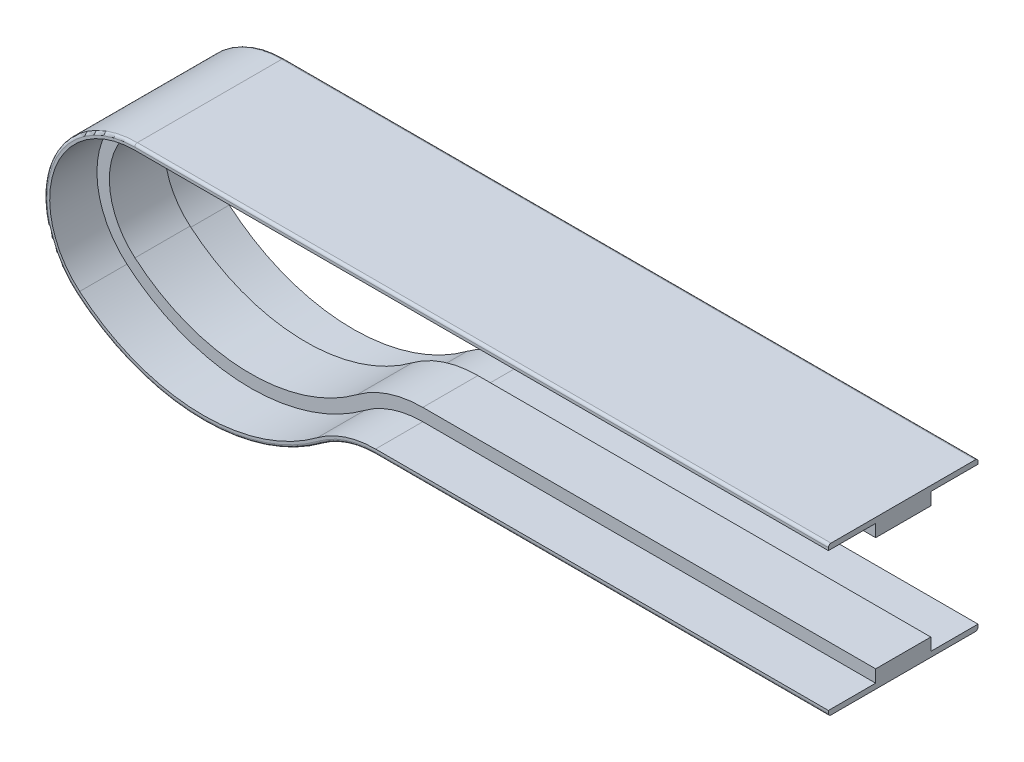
ISO-10303-21;
HEADER;
FILE_DESCRIPTION(('STEP AP214'),'2;1');
FILE_NAME('part.step','',(''),(''),'','','');
FILE_SCHEMA(('AUTOMOTIVE_DESIGN { 1 0 10303 214 1 1 1 1 }'));
ENDSEC;
DATA;
#1=APPLICATION_CONTEXT('core data for automotive mechanical design processes');
#2=APPLICATION_PROTOCOL_DEFINITION('international standard','automotive_design',2000,#1);
#3=PRODUCT_CONTEXT('',#1,'mechanical');
#4=PRODUCT('Part','Part','',(#3));
#5=PRODUCT_RELATED_PRODUCT_CATEGORY('part','',(#4));
#6=PRODUCT_DEFINITION_FORMATION('','',#4);
#7=PRODUCT_DEFINITION_CONTEXT('part definition',#1,'design');
#8=PRODUCT_DEFINITION('design','',#6,#7);
#9=PRODUCT_DEFINITION_SHAPE('','',#8);
#10=(LENGTH_UNIT() NAMED_UNIT(*) SI_UNIT(.MILLI.,.METRE.));
#11=(NAMED_UNIT(*) PLANE_ANGLE_UNIT() SI_UNIT($,.RADIAN.));
#12=(NAMED_UNIT(*) SI_UNIT($,.STERADIAN.) SOLID_ANGLE_UNIT());
#13=UNCERTAINTY_MEASURE_WITH_UNIT(LENGTH_MEASURE(1.E-05),#10,'distance_accuracy_value','');
#14=(GEOMETRIC_REPRESENTATION_CONTEXT(3) GLOBAL_UNCERTAINTY_ASSIGNED_CONTEXT((#13)) GLOBAL_UNIT_ASSIGNED_CONTEXT((#10,
#11,#12)) REPRESENTATION_CONTEXT('',''));
#15=CARTESIAN_POINT('',(0.,0.,0.));
#16=DIRECTION('',(0.,0.,1.));
#17=DIRECTION('',(1.,0.,0.));
#18=AXIS2_PLACEMENT_3D('',#15,#16,#17);
#19=CARTESIAN_POINT('',(-346.,-100.25,21.05));
#20=DIRECTION('',(0.,-1.,0.));
#21=DIRECTION('',(1.,0.,0.));
#22=AXIS2_PLACEMENT_3D('',#19,#20,#21);
#23=PLANE('',#22);
#24=DIRECTION('',(0.,0.,-1.));
#25=VECTOR('',#24,1.);
#26=CARTESIAN_POINT('',(-346.,-100.25,21.05));
#27=LINE('',#26,#25);
#28=CARTESIAN_POINT('',(-346.,-100.25,21.05));
#29=VERTEX_POINT('',#28);
#30=CARTESIAN_POINT('',(-346.,-100.25,-21.0500000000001));
#31=VERTEX_POINT('',#30);
#32=EDGE_CURVE('E418',#29,#31,#27,.T.);
#33=ORIENTED_EDGE('',*,*,#32,.F.);
#34=DIRECTION('',(1.,0.,0.));
#35=VECTOR('',#34,1.);
#36=CARTESIAN_POINT('',(-346.,-100.25,21.05));
#37=LINE('',#36,#35);
#38=CARTESIAN_POINT('',(1.11022302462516E-13,-100.25,21.05));
#39=VERTEX_POINT('',#38);
#40=EDGE_CURVE('E46',#29,#39,#37,.T.);
#41=ORIENTED_EDGE('',*,*,#40,.T.);
#42=DIRECTION('',(0.,0.,-1.));
#43=VECTOR('',#42,1.);
#44=CARTESIAN_POINT('',(1.11022302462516E-13,-100.25,21.05));
#45=LINE('',#44,#43);
#46=CARTESIAN_POINT('',(1.11022302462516E-13,-100.25,-21.05));
#47=VERTEX_POINT('',#46);
#48=EDGE_CURVE('E53',#39,#47,#45,.T.);
#49=ORIENTED_EDGE('',*,*,#48,.T.);
#50=DIRECTION('',(1.,0.,0.));
#51=VECTOR('',#50,1.);
#52=CARTESIAN_POINT('',(-346.,-100.25,-21.0500000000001));
#53=LINE('',#52,#51);
#54=EDGE_CURVE('E11',#31,#47,#53,.T.);
#55=ORIENTED_EDGE('',*,*,#54,.F.);
#56=EDGE_LOOP('',(#33,#41,#49,#55));
#57=FACE_BOUND('',#56,.T.);
#58=ADVANCED_FACE('F38',(#57),#23,.F.);
#59=CARTESIAN_POINT('',(-346.,-109.75,57.15));
#60=DIRECTION('',(0.,-1.,0.));
#61=DIRECTION('',(1.,0.,0.));
#62=AXIS2_PLACEMENT_3D('',#59,#60,#61);
#63=PLANE('',#62);
#64=DIRECTION('',(0.,0.,-1.));
#65=VECTOR('',#64,1.);
#66=CARTESIAN_POINT('',(-346.,-109.75,57.15));
#67=LINE('',#66,#65);
#68=CARTESIAN_POINT('',(-346.,-109.75,57.15));
#69=VERTEX_POINT('',#68);
#70=CARTESIAN_POINT('',(-346.,-109.75,21.05));
#71=VERTEX_POINT('',#70);
#72=EDGE_CURVE('E414',#69,#71,#67,.T.);
#73=ORIENTED_EDGE('',*,*,#72,.F.);
#74=DIRECTION('',(1.,0.,0.));
#75=VECTOR('',#74,1.);
#76=CARTESIAN_POINT('',(-346.,-109.75,57.15));
#77=LINE('',#76,#75);
#78=CARTESIAN_POINT('',(0.,-109.75,57.1500000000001));
#79=VERTEX_POINT('',#78);
#80=EDGE_CURVE('E514',#69,#79,#77,.T.);
#81=ORIENTED_EDGE('',*,*,#80,.T.);
#82=DIRECTION('',(0.,0.,-1.));
#83=VECTOR('',#82,1.);
#84=CARTESIAN_POINT('',(0.,-109.75,57.1500000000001));
#85=LINE('',#84,#83);
#86=CARTESIAN_POINT('',(0.,-109.75,21.05));
#87=VERTEX_POINT('',#86);
#88=EDGE_CURVE('E483',#79,#87,#85,.T.);
#89=ORIENTED_EDGE('',*,*,#88,.T.);
#90=DIRECTION('',(1.,0.,0.));
#91=VECTOR('',#90,1.);
#92=CARTESIAN_POINT('',(-346.,-109.75,21.05));
#93=LINE('',#92,#91);
#94=EDGE_CURVE('E518',#71,#87,#93,.T.);
#95=ORIENTED_EDGE('',*,*,#94,.F.);
#96=EDGE_LOOP('',(#73,#81,#89,#95));
#97=FACE_BOUND('',#96,.T.);
#98=ADVANCED_FACE('F680',(#97),#63,.F.);
#99=CARTESIAN_POINT('',(-346.,-111.75,55.15));
#100=DIRECTION('',(1.,0.,0.));
#101=DIRECTION('',(0.,1.,0.));
#102=AXIS2_PLACEMENT_3D('',#99,#100,#101);
#103=CYLINDRICAL_SURFACE('',#102,2.);
#104=CARTESIAN_POINT('',(-346.,-111.75,55.15));
#105=DIRECTION('',(-1.,0.,0.));
#106=DIRECTION('',(0.,0.,-1.));
#107=AXIS2_PLACEMENT_3D('',#104,#105,#106);
#108=CIRCLE('',#107,2.);
#109=CARTESIAN_POINT('',(-346.,-113.75,55.15));
#110=VERTEX_POINT('',#109);
#111=CARTESIAN_POINT('',(-346.,-111.75,57.15));
#112=VERTEX_POINT('',#111);
#113=EDGE_CURVE('E410',#110,#112,#108,.T.);
#114=ORIENTED_EDGE('',*,*,#113,.F.);
#115=DIRECTION('',(1.,0.,0.));
#116=VECTOR('',#115,1.);
#117=CARTESIAN_POINT('',(-346.,-113.75,55.15));
#118=LINE('',#117,#116);
#119=CARTESIAN_POINT('',(-1.11022302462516E-13,-113.75,55.15));
#120=VERTEX_POINT('',#119);
#121=EDGE_CURVE('E506',#110,#120,#118,.T.);
#122=ORIENTED_EDGE('',*,*,#121,.T.);
#123=CARTESIAN_POINT('',(-1.11022302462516E-13,-111.75,55.1500000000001));
#124=DIRECTION('',(-1.,0.,0.));
#125=DIRECTION('',(0.,0.,-1.));
#126=AXIS2_PLACEMENT_3D('',#123,#124,#125);
#127=CIRCLE('',#126,2.);
#128=CARTESIAN_POINT('',(-1.11022302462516E-13,-111.75,57.1500000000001));
#129=VERTEX_POINT('',#128);
#130=EDGE_CURVE('E477',#120,#129,#127,.T.);
#131=ORIENTED_EDGE('',*,*,#130,.T.);
#132=DIRECTION('',(1.,0.,0.));
#133=VECTOR('',#132,1.);
#134=CARTESIAN_POINT('',(-346.,-111.75,57.15));
#135=LINE('',#134,#133);
#136=EDGE_CURVE('E510',#112,#129,#135,.T.);
#137=ORIENTED_EDGE('',*,*,#136,.F.);
#138=EDGE_LOOP('',(#114,#122,#131,#137));
#139=FACE_BOUND('',#138,.T.);
#140=ADVANCED_FACE('F685',(#139),#103,.T.);
#141=CARTESIAN_POINT('',(-346.,-113.75,55.15));
#142=DIRECTION('',(0.,1.,0.));
#143=DIRECTION('',(-1.,0.,0.));
#144=AXIS2_PLACEMENT_3D('',#141,#142,#143);
#145=PLANE('',#144);
#146=DIRECTION('',(0.,0.,1.));
#147=VECTOR('',#146,1.);
#148=CARTESIAN_POINT('',(-346.,-113.75,55.15));
#149=LINE('',#148,#147);
#150=CARTESIAN_POINT('',(-346.,-113.75,-55.15));
#151=VERTEX_POINT('',#150);
#152=EDGE_CURVE('E406',#151,#110,#149,.T.);
#153=ORIENTED_EDGE('',*,*,#152,.F.);
#154=DIRECTION('',(1.,0.,0.));
#155=VECTOR('',#154,1.);
#156=CARTESIAN_POINT('',(-346.,-113.75,-55.15));
#157=LINE('',#156,#155);
#158=CARTESIAN_POINT('',(-2.22044604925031E-13,-113.75,-55.1499999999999));
#159=VERTEX_POINT('',#158);
#160=EDGE_CURVE('E502',#151,#159,#157,.T.);
#161=ORIENTED_EDGE('',*,*,#160,.T.);
#162=DIRECTION('',(0.,0.,1.));
#163=VECTOR('',#162,1.);
#164=CARTESIAN_POINT('',(-1.11022302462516E-13,-113.75,55.15));
#165=LINE('',#164,#163);
#166=EDGE_CURVE('E474',#159,#120,#165,.T.);
#167=ORIENTED_EDGE('',*,*,#166,.T.);
#168=ORIENTED_EDGE('',*,*,#121,.F.);
#169=EDGE_LOOP('',(#153,#161,#167,#168));
#170=FACE_BOUND('',#169,.T.);
#171=ADVANCED_FACE('F693',(#170),#145,.F.);
#172=CARTESIAN_POINT('',(-346.,-111.75,-55.15));
#173=DIRECTION('',(1.,0.,0.));
#174=DIRECTION('',(0.,1.,0.));
#175=AXIS2_PLACEMENT_3D('',#172,#173,#174);
#176=CYLINDRICAL_SURFACE('',#175,2.);
#177=CARTESIAN_POINT('',(-346.,-111.75,-55.15));
#178=DIRECTION('',(-1.,0.,0.));
#179=DIRECTION('',(0.,0.,-1.));
#180=AXIS2_PLACEMENT_3D('',#177,#178,#179);
#181=CIRCLE('',#180,2.);
#182=CARTESIAN_POINT('',(-346.,-111.75,-57.15));
#183=VERTEX_POINT('',#182);
#184=EDGE_CURVE('E402',#183,#151,#181,.T.);
#185=ORIENTED_EDGE('',*,*,#184,.F.);
#186=DIRECTION('',(1.,0.,0.));
#187=VECTOR('',#186,1.);
#188=CARTESIAN_POINT('',(-346.,-111.75,-57.15));
#189=LINE('',#188,#187);
#190=CARTESIAN_POINT('',(0.,-111.75,-57.1499999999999));
#191=VERTEX_POINT('',#190);
#192=EDGE_CURVE('E498',#183,#191,#189,.T.);
#193=ORIENTED_EDGE('',*,*,#192,.T.);
#194=CARTESIAN_POINT('',(-1.11022302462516E-13,-111.75,-55.1499999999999));
#195=DIRECTION('',(-1.,0.,0.));
#196=DIRECTION('',(0.,0.,-1.));
#197=AXIS2_PLACEMENT_3D('',#194,#195,#196);
#198=CIRCLE('',#197,2.);
#199=EDGE_CURVE('E471',#191,#159,#198,.T.);
#200=ORIENTED_EDGE('',*,*,#199,.T.);
#201=ORIENTED_EDGE('',*,*,#160,.F.);
#202=EDGE_LOOP('',(#185,#193,#200,#201));
#203=FACE_BOUND('',#202,.T.);
#204=ADVANCED_FACE('F638',(#203),#176,.T.);
#205=CARTESIAN_POINT('',(-346.,-109.75,-21.05));
#206=DIRECTION('',(0.,-1.,0.));
#207=DIRECTION('',(0.,0.,-1.));
#208=AXIS2_PLACEMENT_3D('',#205,#206,#207);
#209=PLANE('',#208);
#210=DIRECTION('',(0.,0.,-1.));
#211=VECTOR('',#210,1.);
#212=CARTESIAN_POINT('',(-346.,-109.75,-21.05));
#213=LINE('',#212,#211);
#214=CARTESIAN_POINT('',(-346.,-109.75,-21.05));
#215=VERTEX_POINT('',#214);
#216=CARTESIAN_POINT('',(-346.,-109.75,-57.15));
#217=VERTEX_POINT('',#216);
#218=EDGE_CURVE('E398',#215,#217,#213,.T.);
#219=ORIENTED_EDGE('',*,*,#218,.F.);
#220=DIRECTION('',(1.,0.,0.));
#221=VECTOR('',#220,1.);
#222=CARTESIAN_POINT('',(-346.,-109.75,-21.05));
#223=LINE('',#222,#221);
#224=CARTESIAN_POINT('',(0.,-109.75,-21.0499999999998));
#225=VERTEX_POINT('',#224);
#226=EDGE_CURVE('E490',#215,#225,#223,.T.);
#227=ORIENTED_EDGE('',*,*,#226,.T.);
#228=DIRECTION('',(0.,0.,-1.));
#229=VECTOR('',#228,1.);
#230=CARTESIAN_POINT('',(0.,-109.75,-21.0499999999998));
#231=LINE('',#230,#229);
#232=CARTESIAN_POINT('',(0.,-109.75,-57.1499999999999));
#233=VERTEX_POINT('',#232);
#234=EDGE_CURVE('E465',#225,#233,#231,.T.);
#235=ORIENTED_EDGE('',*,*,#234,.T.);
#236=DIRECTION('',(1.,0.,0.));
#237=VECTOR('',#236,1.);
#238=CARTESIAN_POINT('',(-346.,-109.75,-57.15));
#239=LINE('',#238,#237);
#240=EDGE_CURVE('E494',#217,#233,#239,.T.);
#241=ORIENTED_EDGE('',*,*,#240,.F.);
#242=EDGE_LOOP('',(#219,#227,#235,#241));
#243=FACE_BOUND('',#242,.T.);
#244=ADVANCED_FACE('F628',(#243),#209,.F.);
#245=CARTESIAN_POINT('',(-346.,-184.25,0.));
#246=DIRECTION('',(0.,0.,-1.));
#247=DIRECTION('',(-1.,0.,0.));
#248=AXIS2_PLACEMENT_3D('',#245,#246,#247);
#249=CYLINDRICAL_SURFACE('',#248,84.);
#250=DIRECTION('',(0.,0.,-1.));
#251=VECTOR('',#250,1.);
#252=CARTESIAN_POINT('',(-396.110660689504,-116.833965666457,21.05));
#253=LINE('',#252,#251);
#254=CARTESIAN_POINT('',(-396.110660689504,-116.833965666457,21.05));
#255=VERTEX_POINT('',#254);
#256=CARTESIAN_POINT('',(-396.110660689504,-116.833965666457,-21.0499999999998));
#257=VERTEX_POINT('',#256);
#258=EDGE_CURVE('E356',#255,#257,#253,.T.);
#259=ORIENTED_EDGE('',*,*,#258,.F.);
#260=CARTESIAN_POINT('',(-346.,-184.25,21.05));
#261=DIRECTION('',(0.,0.,-1.));
#262=DIRECTION('',(-1.,0.,0.));
#263=AXIS2_PLACEMENT_3D('',#260,#261,#262);
#264=CIRCLE('',#263,84.);
#265=EDGE_CURVE('E454',#255,#29,#264,.T.);
#266=ORIENTED_EDGE('',*,*,#265,.T.);
#267=ORIENTED_EDGE('',*,*,#32,.T.);
#268=CARTESIAN_POINT('',(-346.,-184.25,-21.0500000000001));
#269=DIRECTION('',(0.,0.,-1.));
#270=DIRECTION('',(-1.,0.,0.));
#271=AXIS2_PLACEMENT_3D('',#268,#269,#270);
#272=CIRCLE('',#271,84.);
#273=EDGE_CURVE('E458',#257,#31,#272,.T.);
#274=ORIENTED_EDGE('',*,*,#273,.F.);
#275=EDGE_LOOP('',(#259,#266,#267,#274));
#276=FACE_BOUND('',#275,.T.);
#277=ADVANCED_FACE('F527',(#276),#249,.T.);
#278=CARTESIAN_POINT('',(-346.,-184.25,0.));
#279=DIRECTION('',(0.,0.,-1.));
#280=DIRECTION('',(-1.,0.,0.));
#281=AXIS2_PLACEMENT_3D('',#278,#279,#280);
#282=CYLINDRICAL_SURFACE('',#281,74.4999999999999);
#283=DIRECTION('',(0.,0.,-1.));
#284=VECTOR('',#283,1.);
#285=CARTESIAN_POINT('',(-390.443383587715,-124.458398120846,57.15));
#286=LINE('',#285,#284);
#287=CARTESIAN_POINT('',(-390.443383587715,-124.458398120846,57.15));
#288=VERTEX_POINT('',#287);
#289=CARTESIAN_POINT('',(-390.443383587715,-124.458398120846,21.0499999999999));
#290=VERTEX_POINT('',#289);
#291=EDGE_CURVE('E352',#288,#290,#286,.T.);
#292=ORIENTED_EDGE('',*,*,#291,.F.);
#293=CARTESIAN_POINT('',(-346.,-184.25,57.1500000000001));
#294=DIRECTION('',(0.,0.,-1.));
#295=DIRECTION('',(-1.,0.,0.));
#296=AXIS2_PLACEMENT_3D('',#293,#294,#295);
#297=CIRCLE('',#296,74.4999999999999);
#298=EDGE_CURVE('E446',#288,#69,#297,.T.);
#299=ORIENTED_EDGE('',*,*,#298,.T.);
#300=ORIENTED_EDGE('',*,*,#72,.T.);
#301=CARTESIAN_POINT('',(-346.,-184.25,21.05));
#302=DIRECTION('',(0.,0.,-1.));
#303=DIRECTION('',(-1.,0.,0.));
#304=AXIS2_PLACEMENT_3D('',#301,#302,#303);
#305=CIRCLE('',#304,74.4999999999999);
#306=EDGE_CURVE('E450',#290,#71,#305,.T.);
#307=ORIENTED_EDGE('',*,*,#306,.F.);
#308=EDGE_LOOP('',(#292,#299,#300,#307));
#309=FACE_BOUND('',#308,.T.);
#310=ADVANCED_FACE('F677',(#309),#282,.T.);
#311=CARTESIAN_POINT('',(-346.,-184.25,55.1500000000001));
#312=DIRECTION('',(0.,0.,-1.));
#313=DIRECTION('',(-1.,0.,0.));
#314=AXIS2_PLACEMENT_3D('',#311,#312,#313);
#315=TOROIDAL_SURFACE('',#314,72.4999999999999,2.);
#316=CARTESIAN_POINT('',(-389.250272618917,-126.063541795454,55.15));
#317=DIRECTION('',(-0.802571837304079,-0.596555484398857,0.));
#318=DIRECTION('',(0.,0.,-1.));
#319=AXIS2_PLACEMENT_3D('',#316,#317,#318);
#320=CIRCLE('',#319,2.);
#321=CARTESIAN_POINT('',(-388.057161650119,-127.668685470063,55.15));
#322=VERTEX_POINT('',#321);
#323=CARTESIAN_POINT('',(-389.250272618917,-126.063541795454,57.15));
#324=VERTEX_POINT('',#323);
#325=EDGE_CURVE('E348',#322,#324,#320,.T.);
#326=ORIENTED_EDGE('',*,*,#325,.F.);
#327=CARTESIAN_POINT('',(-346.,-184.25,55.1500000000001));
#328=DIRECTION('',(0.,0.,-1.));
#329=DIRECTION('',(-1.,0.,0.));
#330=AXIS2_PLACEMENT_3D('',#327,#328,#329);
#331=CIRCLE('',#330,70.4999999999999);
#332=EDGE_CURVE('E438',#322,#110,#331,.T.);
#333=ORIENTED_EDGE('',*,*,#332,.T.);
#334=ORIENTED_EDGE('',*,*,#113,.T.);
#335=CARTESIAN_POINT('',(-346.,-184.25,57.1500000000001));
#336=DIRECTION('',(0.,0.,-1.));
#337=DIRECTION('',(-1.,0.,0.));
#338=AXIS2_PLACEMENT_3D('',#335,#336,#337);
#339=CIRCLE('',#338,72.4999999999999);
#340=EDGE_CURVE('E442',#324,#112,#339,.T.);
#341=ORIENTED_EDGE('',*,*,#340,.F.);
#342=EDGE_LOOP('',(#326,#333,#334,#341));
#343=FACE_BOUND('',#342,.T.);
#344=ADVANCED_FACE('F688',(#343),#315,.T.);
#345=CARTESIAN_POINT('',(-346.,-184.25,0.));
#346=DIRECTION('',(0.,0.,-1.));
#347=DIRECTION('',(-1.,0.,0.));
#348=AXIS2_PLACEMENT_3D('',#345,#346,#347);
#349=CYLINDRICAL_SURFACE('',#348,70.4999999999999);
#350=DIRECTION('',(0.,0.,1.));
#351=VECTOR('',#350,1.);
#352=CARTESIAN_POINT('',(-388.057161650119,-127.668685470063,55.15));
#353=LINE('',#352,#351);
#354=CARTESIAN_POINT('',(-388.057161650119,-127.668685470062,-55.15));
#355=VERTEX_POINT('',#354);
#356=EDGE_CURVE('E344',#355,#322,#353,.T.);
#357=ORIENTED_EDGE('',*,*,#356,.F.);
#358=CARTESIAN_POINT('',(-346.,-184.25,-55.15));
#359=DIRECTION('',(0.,0.,-1.));
#360=DIRECTION('',(-1.,0.,0.));
#361=AXIS2_PLACEMENT_3D('',#358,#359,#360);
#362=CIRCLE('',#361,70.4999999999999);
#363=EDGE_CURVE('E434',#355,#151,#362,.T.);
#364=ORIENTED_EDGE('',*,*,#363,.T.);
#365=ORIENTED_EDGE('',*,*,#152,.T.);
#366=ORIENTED_EDGE('',*,*,#332,.F.);
#367=EDGE_LOOP('',(#357,#364,#365,#366));
#368=FACE_BOUND('',#367,.T.);
#369=ADVANCED_FACE('F691',(#368),#349,.F.);
#370=CARTESIAN_POINT('',(-346.,-184.25,-55.15));
#371=DIRECTION('',(0.,0.,-1.));
#372=DIRECTION('',(-1.,0.,0.));
#373=AXIS2_PLACEMENT_3D('',#370,#371,#372);
#374=TOROIDAL_SURFACE('',#373,72.4999999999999,2.);
#375=CARTESIAN_POINT('',(-389.250272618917,-126.063541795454,-55.15));
#376=DIRECTION('',(-0.802571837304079,-0.596555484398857,0.));
#377=DIRECTION('',(0.,0.,-1.));
#378=AXIS2_PLACEMENT_3D('',#375,#376,#377);
#379=CIRCLE('',#378,2.);
#380=CARTESIAN_POINT('',(-389.250272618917,-126.063541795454,-57.15));
#381=VERTEX_POINT('',#380);
#382=EDGE_CURVE('E340',#381,#355,#379,.T.);
#383=ORIENTED_EDGE('',*,*,#382,.F.);
#384=CARTESIAN_POINT('',(-346.,-184.25,-57.15));
#385=DIRECTION('',(0.,0.,-1.));
#386=DIRECTION('',(-1.,0.,0.));
#387=AXIS2_PLACEMENT_3D('',#384,#385,#386);
#388=CIRCLE('',#387,72.4999999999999);
#389=EDGE_CURVE('E430',#381,#183,#388,.T.);
#390=ORIENTED_EDGE('',*,*,#389,.T.);
#391=ORIENTED_EDGE('',*,*,#184,.T.);
#392=ORIENTED_EDGE('',*,*,#363,.F.);
#393=EDGE_LOOP('',(#383,#390,#391,#392));
#394=FACE_BOUND('',#393,.T.);
#395=ADVANCED_FACE('F642',(#394),#374,.T.);
#396=CARTESIAN_POINT('',(-346.,-184.25,0.));
#397=DIRECTION('',(0.,0.,-1.));
#398=DIRECTION('',(-1.,0.,0.));
#399=AXIS2_PLACEMENT_3D('',#396,#397,#398);
#400=CYLINDRICAL_SURFACE('',#399,74.4999999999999);
#401=DIRECTION('',(0.,0.,-1.));
#402=VECTOR('',#401,1.);
#403=CARTESIAN_POINT('',(-390.443383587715,-124.458398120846,-21.05));
#404=LINE('',#403,#402);
#405=CARTESIAN_POINT('',(-390.443383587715,-124.458398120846,-21.05));
#406=VERTEX_POINT('',#405);
#407=CARTESIAN_POINT('',(-390.443383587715,-124.458398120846,-57.15));
#408=VERTEX_POINT('',#407);
#409=EDGE_CURVE('E336',#406,#408,#404,.T.);
#410=ORIENTED_EDGE('',*,*,#409,.F.);
#411=CARTESIAN_POINT('',(-346.,-184.25,-21.05));
#412=DIRECTION('',(0.,0.,-1.));
#413=DIRECTION('',(-1.,0.,0.));
#414=AXIS2_PLACEMENT_3D('',#411,#412,#413);
#415=CIRCLE('',#414,74.4999999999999);
#416=EDGE_CURVE('E422',#406,#215,#415,.T.);
#417=ORIENTED_EDGE('',*,*,#416,.T.);
#418=ORIENTED_EDGE('',*,*,#218,.T.);
#419=CARTESIAN_POINT('',(-346.,-184.25,-57.15));
#420=DIRECTION('',(0.,0.,-1.));
#421=DIRECTION('',(-1.,0.,0.));
#422=AXIS2_PLACEMENT_3D('',#419,#420,#421);
#423=CIRCLE('',#422,74.4999999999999);
#424=EDGE_CURVE('E426',#408,#217,#423,.T.);
#425=ORIENTED_EDGE('',*,*,#424,.F.);
#426=EDGE_LOOP('',(#410,#417,#418,#425));
#427=FACE_BOUND('',#426,.T.);
#428=ADVANCED_FACE('F631',(#427),#400,.T.);
#429=CARTESIAN_POINT('',(-477.540484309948,-7.28290987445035,0.));
#430=DIRECTION('',(0.,0.,1.));
#431=DIRECTION('',(1.,0.,0.));
#432=AXIS2_PLACEMENT_3D('',#429,#430,#431);
#433=CYLINDRICAL_SURFACE('',#432,136.5);
#434=DIRECTION('',(0.,0.,-1.));
#435=VECTOR('',#434,1.);
#436=CARTESIAN_POINT('',(-565.944482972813,-111.287635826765,21.05));
#437=LINE('',#436,#435);
#438=CARTESIAN_POINT('',(-565.944482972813,-111.287635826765,21.05));
#439=VERTEX_POINT('',#438);
#440=CARTESIAN_POINT('',(-565.944482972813,-111.287635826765,-21.05));
#441=VERTEX_POINT('',#440);
#442=EDGE_CURVE('E249',#439,#441,#437,.T.);
#443=ORIENTED_EDGE('',*,*,#442,.F.);
#444=CARTESIAN_POINT('',(-477.540484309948,-7.28290987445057,21.05));
#445=DIRECTION('',(0.,0.,1.));
#446=DIRECTION('',(1.,0.,0.));
#447=AXIS2_PLACEMENT_3D('',#444,#445,#446);
#448=CIRCLE('',#447,136.5);
#449=EDGE_CURVE('E390',#439,#255,#448,.T.);
#450=ORIENTED_EDGE('',*,*,#449,.T.);
#451=ORIENTED_EDGE('',*,*,#258,.T.);
#452=CARTESIAN_POINT('',(-477.540484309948,-7.28290987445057,-21.05));
#453=DIRECTION('',(0.,0.,1.));
#454=DIRECTION('',(1.,0.,0.));
#455=AXIS2_PLACEMENT_3D('',#452,#453,#454);
#456=CIRCLE('',#455,136.5);
#457=EDGE_CURVE('E394',#441,#257,#456,.T.);
#458=ORIENTED_EDGE('',*,*,#457,.F.);
#459=EDGE_LOOP('',(#443,#450,#451,#458));
#460=FACE_BOUND('',#459,.T.);
#461=ADVANCED_FACE('F529',(#460),#433,.F.);
#462=CARTESIAN_POINT('',(-477.540484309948,-7.28290987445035,0.));
#463=DIRECTION('',(0.,0.,1.));
#464=DIRECTION('',(1.,0.,0.));
#465=AXIS2_PLACEMENT_3D('',#462,#463,#464);
#466=CYLINDRICAL_SURFACE('',#465,146.);
#467=DIRECTION('',(0.,0.,-1.));
#468=VECTOR('',#467,1.);
#469=CARTESIAN_POINT('',(-572.097142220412,-118.526059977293,57.15));
#470=LINE('',#469,#468);
#471=CARTESIAN_POINT('',(-572.097142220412,-118.526059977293,57.15));
#472=VERTEX_POINT('',#471);
#473=CARTESIAN_POINT('',(-572.097142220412,-118.526059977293,21.05));
#474=VERTEX_POINT('',#473);
#475=EDGE_CURVE('E296',#472,#474,#470,.T.);
#476=ORIENTED_EDGE('',*,*,#475,.F.);
#477=CARTESIAN_POINT('',(-477.540484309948,-7.28290987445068,57.15));
#478=DIRECTION('',(0.,0.,1.));
#479=DIRECTION('',(1.,0.,0.));
#480=AXIS2_PLACEMENT_3D('',#477,#478,#479);
#481=CIRCLE('',#480,146.);
#482=EDGE_CURVE('E382',#472,#288,#481,.T.);
#483=ORIENTED_EDGE('',*,*,#482,.T.);
#484=ORIENTED_EDGE('',*,*,#291,.T.);
#485=CARTESIAN_POINT('',(-477.540484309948,-7.28290987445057,21.05));
#486=DIRECTION('',(0.,0.,1.));
#487=DIRECTION('',(1.,0.,0.));
#488=AXIS2_PLACEMENT_3D('',#485,#486,#487);
#489=CIRCLE('',#488,146.);
#490=EDGE_CURVE('E386',#474,#290,#489,.T.);
#491=ORIENTED_EDGE('',*,*,#490,.F.);
#492=EDGE_LOOP('',(#476,#483,#484,#491));
#493=FACE_BOUND('',#492,.T.);
#494=ADVANCED_FACE('F674',(#493),#466,.F.);
#495=CARTESIAN_POINT('',(-477.540484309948,-7.28290987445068,55.15));
#496=DIRECTION('',(0.,0.,1.));
#497=DIRECTION('',(1.,0.,0.));
#498=AXIS2_PLACEMENT_3D('',#495,#496,#497);
#499=TOROIDAL_SURFACE('',#498,148.,2.);
#500=CARTESIAN_POINT('',(-573.392438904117,-120.049938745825,55.15));
#501=DIRECTION('',(-0.761939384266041,0.647648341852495,0.));
#502=DIRECTION('',(0.,0.,-1.));
#503=AXIS2_PLACEMENT_3D('',#500,#501,#502);
#504=CIRCLE('',#503,2.);
#505=CARTESIAN_POINT('',(-574.687735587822,-121.573817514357,55.15));
#506=VERTEX_POINT('',#505);
#507=CARTESIAN_POINT('',(-573.392438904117,-120.049938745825,57.15));
#508=VERTEX_POINT('',#507);
#509=EDGE_CURVE('E292',#506,#508,#504,.T.);
#510=ORIENTED_EDGE('',*,*,#509,.F.);
#511=CARTESIAN_POINT('',(-477.540484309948,-7.28290987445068,55.15));
#512=DIRECTION('',(0.,0.,1.));
#513=DIRECTION('',(1.,0.,0.));
#514=AXIS2_PLACEMENT_3D('',#511,#512,#513);
#515=CIRCLE('',#514,150.);
#516=EDGE_CURVE('E374',#506,#322,#515,.T.);
#517=ORIENTED_EDGE('',*,*,#516,.T.);
#518=ORIENTED_EDGE('',*,*,#325,.T.);
#519=CARTESIAN_POINT('',(-477.540484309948,-7.28290987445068,57.15));
#520=DIRECTION('',(0.,0.,1.));
#521=DIRECTION('',(1.,0.,0.));
#522=AXIS2_PLACEMENT_3D('',#519,#520,#521);
#523=CIRCLE('',#522,148.);
#524=EDGE_CURVE('E378',#508,#324,#523,.T.);
#525=ORIENTED_EDGE('',*,*,#524,.F.);
#526=EDGE_LOOP('',(#510,#517,#518,#525));
#527=FACE_BOUND('',#526,.T.);
#528=ADVANCED_FACE('F784',(#527),#499,.T.);
#529=CARTESIAN_POINT('',(-477.540484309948,-7.28290987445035,0.));
#530=DIRECTION('',(0.,0.,1.));
#531=DIRECTION('',(1.,0.,0.));
#532=AXIS2_PLACEMENT_3D('',#529,#530,#531);
#533=CYLINDRICAL_SURFACE('',#532,150.);
#534=DIRECTION('',(0.,0.,1.));
#535=VECTOR('',#534,1.);
#536=CARTESIAN_POINT('',(-574.687735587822,-121.573817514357,55.15));
#537=LINE('',#536,#535);
#538=CARTESIAN_POINT('',(-574.687735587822,-121.573817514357,-55.15));
#539=VERTEX_POINT('',#538);
#540=EDGE_CURVE('E288',#539,#506,#537,.T.);
#541=ORIENTED_EDGE('',*,*,#540,.F.);
#542=CARTESIAN_POINT('',(-477.540484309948,-7.28290987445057,-55.15));
#543=DIRECTION('',(0.,0.,1.));
#544=DIRECTION('',(1.,0.,0.));
#545=AXIS2_PLACEMENT_3D('',#542,#543,#544);
#546=CIRCLE('',#545,150.);
#547=EDGE_CURVE('E370',#539,#355,#546,.T.);
#548=ORIENTED_EDGE('',*,*,#547,.T.);
#549=ORIENTED_EDGE('',*,*,#356,.T.);
#550=ORIENTED_EDGE('',*,*,#516,.F.);
#551=EDGE_LOOP('',(#541,#548,#549,#550));
#552=FACE_BOUND('',#551,.T.);
#553=ADVANCED_FACE('F792',(#552),#533,.T.);
#554=CARTESIAN_POINT('',(-477.540484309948,-7.28290987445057,-55.15));
#555=DIRECTION('',(0.,0.,1.));
#556=DIRECTION('',(1.,0.,0.));
#557=AXIS2_PLACEMENT_3D('',#554,#555,#556);
#558=TOROIDAL_SURFACE('',#557,148.,2.);
#559=CARTESIAN_POINT('',(-573.392438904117,-120.049938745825,-55.15));
#560=DIRECTION('',(-0.761939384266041,0.647648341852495,0.));
#561=DIRECTION('',(0.,0.,-1.));
#562=AXIS2_PLACEMENT_3D('',#559,#560,#561);
#563=CIRCLE('',#562,2.);
#564=CARTESIAN_POINT('',(-573.392438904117,-120.049938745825,-57.15));
#565=VERTEX_POINT('',#564);
#566=EDGE_CURVE('E283',#565,#539,#563,.T.);
#567=ORIENTED_EDGE('',*,*,#566,.F.);
#568=CARTESIAN_POINT('',(-477.540484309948,-7.28290987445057,-57.15));
#569=DIRECTION('',(0.,0.,1.));
#570=DIRECTION('',(1.,0.,0.));
#571=AXIS2_PLACEMENT_3D('',#568,#569,#570);
#572=CIRCLE('',#571,148.);
#573=EDGE_CURVE('E366',#565,#381,#572,.T.);
#574=ORIENTED_EDGE('',*,*,#573,.T.);
#575=ORIENTED_EDGE('',*,*,#382,.T.);
#576=ORIENTED_EDGE('',*,*,#547,.F.);
#577=EDGE_LOOP('',(#567,#574,#575,#576));
#578=FACE_BOUND('',#577,.T.);
#579=ADVANCED_FACE('F645',(#578),#558,.T.);
#580=CARTESIAN_POINT('',(-477.540484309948,-7.28290987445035,0.));
#581=DIRECTION('',(0.,0.,1.));
#582=DIRECTION('',(1.,0.,0.));
#583=AXIS2_PLACEMENT_3D('',#580,#581,#582);
#584=CYLINDRICAL_SURFACE('',#583,146.);
#585=DIRECTION('',(0.,0.,-1.));
#586=VECTOR('',#585,1.);
#587=CARTESIAN_POINT('',(-572.097142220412,-118.526059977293,-21.05));
#588=LINE('',#587,#586);
#589=CARTESIAN_POINT('',(-572.097142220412,-118.526059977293,-21.05));
#590=VERTEX_POINT('',#589);
#591=CARTESIAN_POINT('',(-572.097142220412,-118.526059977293,-57.15));
#592=VERTEX_POINT('',#591);
#593=EDGE_CURVE('E280',#590,#592,#588,.T.);
#594=ORIENTED_EDGE('',*,*,#593,.F.);
#595=CARTESIAN_POINT('',(-477.540484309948,-7.28290987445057,-21.05));
#596=DIRECTION('',(0.,0.,1.));
#597=DIRECTION('',(1.,0.,0.));
#598=AXIS2_PLACEMENT_3D('',#595,#596,#597);
#599=CIRCLE('',#598,146.);
#600=EDGE_CURVE('E243',#590,#406,#599,.T.);
#601=ORIENTED_EDGE('',*,*,#600,.T.);
#602=ORIENTED_EDGE('',*,*,#409,.T.);
#603=CARTESIAN_POINT('',(-477.540484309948,-7.28290987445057,-57.15));
#604=DIRECTION('',(0.,0.,1.));
#605=DIRECTION('',(1.,0.,0.));
#606=AXIS2_PLACEMENT_3D('',#603,#604,#605);
#607=CIRCLE('',#606,146.);
#608=EDGE_CURVE('E362',#592,#408,#607,.T.);
#609=ORIENTED_EDGE('',*,*,#608,.F.);
#610=EDGE_LOOP('',(#594,#601,#602,#609));
#611=FACE_BOUND('',#610,.T.);
#612=ADVANCED_FACE('F633',(#611),#584,.F.);
#613=CARTESIAN_POINT('',(-530.,-68.9999999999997,0.));
#614=DIRECTION('',(0.,0.,1.));
#615=DIRECTION('',(1.,0.,0.));
#616=AXIS2_PLACEMENT_3D('',#613,#614,#615);
#617=CYLINDRICAL_SURFACE('',#616,55.5);
#618=DIRECTION('',(0.,0.,-1.));
#619=VECTOR('',#618,1.);
#620=CARTESIAN_POINT('',(-530.,-13.5,21.0499999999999));
#621=LINE('',#620,#619);
#622=CARTESIAN_POINT('',(-530.,-13.5,21.0499999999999));
#623=VERTEX_POINT('',#622);
#624=CARTESIAN_POINT('',(-530.,-13.5,-21.0500000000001));
#625=VERTEX_POINT('',#624);
#626=EDGE_CURVE('E267',#623,#625,#621,.T.);
#627=ORIENTED_EDGE('',*,*,#626,.F.);
#628=CARTESIAN_POINT('',(-530.,-68.9999999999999,21.05));
#629=DIRECTION('',(0.,0.,1.));
#630=DIRECTION('',(1.,0.,0.));
#631=AXIS2_PLACEMENT_3D('',#628,#629,#630);
#632=CIRCLE('',#631,55.5);
#633=EDGE_CURVE('E328',#623,#439,#632,.T.);
#634=ORIENTED_EDGE('',*,*,#633,.T.);
#635=ORIENTED_EDGE('',*,*,#442,.T.);
#636=CARTESIAN_POINT('',(-530.,-68.9999999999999,-21.0499999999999));
#637=DIRECTION('',(0.,0.,1.));
#638=DIRECTION('',(1.,0.,0.));
#639=AXIS2_PLACEMENT_3D('',#636,#637,#638);
#640=CIRCLE('',#639,55.5);
#641=EDGE_CURVE('E332',#625,#441,#640,.T.);
#642=ORIENTED_EDGE('',*,*,#641,.F.);
#643=EDGE_LOOP('',(#627,#634,#635,#642));
#644=FACE_BOUND('',#643,.T.);
#645=ADVANCED_FACE('F532',(#644),#617,.F.);
#646=CARTESIAN_POINT('',(-530.,-68.9999999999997,0.));
#647=DIRECTION('',(0.,0.,1.));
#648=DIRECTION('',(1.,0.,0.));
#649=AXIS2_PLACEMENT_3D('',#646,#647,#648);
#650=CYLINDRICAL_SURFACE('',#649,65.);
#651=DIRECTION('',(0.,0.,-1.));
#652=VECTOR('',#651,1.);
#653=CARTESIAN_POINT('',(-530.,-4.,57.15));
#654=LINE('',#653,#652);
#655=CARTESIAN_POINT('',(-530.,-4.,57.15));
#656=VERTEX_POINT('',#655);
#657=CARTESIAN_POINT('',(-530.,-4.,21.0499999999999));
#658=VERTEX_POINT('',#657);
#659=EDGE_CURVE('E276',#656,#658,#654,.T.);
#660=ORIENTED_EDGE('',*,*,#659,.F.);
#661=CARTESIAN_POINT('',(-530.,-68.9999999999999,57.15));
#662=DIRECTION('',(0.,0.,1.));
#663=DIRECTION('',(1.,0.,0.));
#664=AXIS2_PLACEMENT_3D('',#661,#662,#663);
#665=CIRCLE('',#664,65.);
#666=EDGE_CURVE('E320',#656,#472,#665,.T.);
#667=ORIENTED_EDGE('',*,*,#666,.T.);
#668=ORIENTED_EDGE('',*,*,#475,.T.);
#669=CARTESIAN_POINT('',(-530.,-68.9999999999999,21.05));
#670=DIRECTION('',(0.,0.,1.));
#671=DIRECTION('',(1.,0.,0.));
#672=AXIS2_PLACEMENT_3D('',#669,#670,#671);
#673=CIRCLE('',#672,65.);
#674=EDGE_CURVE('E324',#658,#474,#673,.T.);
#675=ORIENTED_EDGE('',*,*,#674,.F.);
#676=EDGE_LOOP('',(#660,#667,#668,#675));
#677=FACE_BOUND('',#676,.T.);
#678=ADVANCED_FACE('F671',(#677),#650,.F.);
#679=CARTESIAN_POINT('',(-530.,-68.9999999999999,55.15));
#680=DIRECTION('',(0.,0.,1.));
#681=DIRECTION('',(1.,0.,0.));
#682=AXIS2_PLACEMENT_3D('',#679,#680,#681);
#683=TOROIDAL_SURFACE('',#682,67.,2.);
#684=CARTESIAN_POINT('',(-530.,-2.,55.15));
#685=DIRECTION('',(1.,0.,0.));
#686=DIRECTION('',(0.,0.,-1.));
#687=AXIS2_PLACEMENT_3D('',#684,#685,#686);
#688=CIRCLE('',#687,2.);
#689=CARTESIAN_POINT('',(-530.,0.,55.15));
#690=VERTEX_POINT('',#689);
#691=CARTESIAN_POINT('',(-530.,-2.,57.15));
#692=VERTEX_POINT('',#691);
#693=EDGE_CURVE('E611',#690,#692,#688,.T.);
#694=ORIENTED_EDGE('',*,*,#693,.F.);
#695=CARTESIAN_POINT('',(-530.,-68.9999999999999,55.15));
#696=DIRECTION('',(0.,0.,1.));
#697=DIRECTION('',(1.,0.,0.));
#698=AXIS2_PLACEMENT_3D('',#695,#696,#697);
#699=CIRCLE('',#698,69.);
#700=EDGE_CURVE('E312',#690,#506,#699,.T.);
#701=ORIENTED_EDGE('',*,*,#700,.T.);
#702=ORIENTED_EDGE('',*,*,#509,.T.);
#703=CARTESIAN_POINT('',(-530.,-68.9999999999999,57.15));
#704=DIRECTION('',(0.,0.,1.));
#705=DIRECTION('',(1.,0.,0.));
#706=AXIS2_PLACEMENT_3D('',#703,#704,#705);
#707=CIRCLE('',#706,67.);
#708=EDGE_CURVE('E316',#692,#508,#707,.T.);
#709=ORIENTED_EDGE('',*,*,#708,.F.);
#710=EDGE_LOOP('',(#694,#701,#702,#709));
#711=FACE_BOUND('',#710,.T.);
#712=ADVANCED_FACE('F662',(#711),#683,.T.);
#713=CARTESIAN_POINT('',(-530.,-68.9999999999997,0.));
#714=DIRECTION('',(0.,0.,1.));
#715=DIRECTION('',(1.,0.,0.));
#716=AXIS2_PLACEMENT_3D('',#713,#714,#715);
#717=CYLINDRICAL_SURFACE('',#716,69.);
#718=DIRECTION('',(0.,0.,1.));
#719=VECTOR('',#718,1.);
#720=CARTESIAN_POINT('',(-530.,0.,55.15));
#721=LINE('',#720,#719);
#722=CARTESIAN_POINT('',(-530.,1.11022302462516E-13,-55.15));
#723=VERTEX_POINT('',#722);
#724=EDGE_CURVE('E618',#723,#690,#721,.T.);
#725=ORIENTED_EDGE('',*,*,#724,.F.);
#726=CARTESIAN_POINT('',(-529.999999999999,-68.9999999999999,-55.1499999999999));
#727=DIRECTION('',(0.,0.,1.));
#728=DIRECTION('',(1.,0.,0.));
#729=AXIS2_PLACEMENT_3D('',#726,#727,#728);
#730=CIRCLE('',#729,69.);
#731=EDGE_CURVE('E308',#723,#539,#730,.T.);
#732=ORIENTED_EDGE('',*,*,#731,.T.);
#733=ORIENTED_EDGE('',*,*,#540,.T.);
#734=ORIENTED_EDGE('',*,*,#700,.F.);
#735=EDGE_LOOP('',(#725,#732,#733,#734));
#736=FACE_BOUND('',#735,.T.);
#737=ADVANCED_FACE('F659',(#736),#717,.T.);
#738=CARTESIAN_POINT('',(-529.999999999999,-68.9999999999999,-55.1499999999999));
#739=DIRECTION('',(0.,0.,1.));
#740=DIRECTION('',(1.,0.,0.));
#741=AXIS2_PLACEMENT_3D('',#738,#739,#740);
#742=TOROIDAL_SURFACE('',#741,67.,2.);
#743=CARTESIAN_POINT('',(-530.,-1.99999999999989,-55.15));
#744=DIRECTION('',(1.,0.,0.));
#745=DIRECTION('',(0.,0.,-1.));
#746=AXIS2_PLACEMENT_3D('',#743,#744,#745);
#747=CIRCLE('',#746,2.);
#748=CARTESIAN_POINT('',(-530.,-1.99999999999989,-57.15));
#749=VERTEX_POINT('',#748);
#750=EDGE_CURVE('E258',#749,#723,#747,.T.);
#751=ORIENTED_EDGE('',*,*,#750,.F.);
#752=CARTESIAN_POINT('',(-530.,-68.9999999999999,-57.1499999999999));
#753=DIRECTION('',(0.,0.,1.));
#754=DIRECTION('',(1.,0.,0.));
#755=AXIS2_PLACEMENT_3D('',#752,#753,#754);
#756=CIRCLE('',#755,67.);
#757=EDGE_CURVE('E305',#749,#565,#756,.T.);
#758=ORIENTED_EDGE('',*,*,#757,.T.);
#759=ORIENTED_EDGE('',*,*,#566,.T.);
#760=ORIENTED_EDGE('',*,*,#731,.F.);
#761=EDGE_LOOP('',(#751,#758,#759,#760));
#762=FACE_BOUND('',#761,.T.);
#763=ADVANCED_FACE('F648',(#762),#742,.T.);
#764=CARTESIAN_POINT('',(-530.,-68.9999999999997,0.));
#765=DIRECTION('',(0.,0.,1.));
#766=DIRECTION('',(1.,0.,0.));
#767=AXIS2_PLACEMENT_3D('',#764,#765,#766);
#768=CYLINDRICAL_SURFACE('',#767,65.);
#769=DIRECTION('',(0.,0.,-1.));
#770=VECTOR('',#769,1.);
#771=CARTESIAN_POINT('',(-530.,-4.,-21.05));
#772=LINE('',#771,#770);
#773=CARTESIAN_POINT('',(-530.,-4.,-21.05));
#774=VERTEX_POINT('',#773);
#775=CARTESIAN_POINT('',(-530.,-3.99999999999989,-57.15));
#776=VERTEX_POINT('',#775);
#777=EDGE_CURVE('E252',#774,#776,#772,.T.);
#778=ORIENTED_EDGE('',*,*,#777,.F.);
#779=CARTESIAN_POINT('',(-530.,-68.9999999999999,-21.0499999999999));
#780=DIRECTION('',(0.,0.,1.));
#781=DIRECTION('',(1.,0.,0.));
#782=AXIS2_PLACEMENT_3D('',#779,#780,#781);
#783=CIRCLE('',#782,65.);
#784=EDGE_CURVE('E235',#774,#590,#783,.T.);
#785=ORIENTED_EDGE('',*,*,#784,.T.);
#786=ORIENTED_EDGE('',*,*,#593,.T.);
#787=CARTESIAN_POINT('',(-530.,-68.9999999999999,-57.1499999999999));
#788=DIRECTION('',(0.,0.,1.));
#789=DIRECTION('',(1.,0.,0.));
#790=AXIS2_PLACEMENT_3D('',#787,#788,#789);
#791=CIRCLE('',#790,65.);
#792=EDGE_CURVE('E248',#776,#592,#791,.T.);
#793=ORIENTED_EDGE('',*,*,#792,.F.);
#794=EDGE_LOOP('',(#778,#785,#786,#793));
#795=FACE_BOUND('',#794,.T.);
#796=ADVANCED_FACE('F253',(#795),#768,.F.);
#797=CARTESIAN_POINT('',(-530.,-13.5,-21.0500000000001));
#798=DIRECTION('',(0.,0.,-1.));
#799=DIRECTION('',(0.,1.,0.));
#800=AXIS2_PLACEMENT_3D('',#797,#798,#799);
#801=PLANE('',#800);
#802=DIRECTION('',(0.,1.,0.));
#803=VECTOR('',#802,1.);
#804=CARTESIAN_POINT('',(0.,-13.5000000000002,-21.05));
#805=LINE('',#804,#803);
#806=CARTESIAN_POINT('',(0.,-13.5000000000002,-21.05));
#807=VERTEX_POINT('',#806);
#808=CARTESIAN_POINT('',(0.,-4.00000000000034,-21.0499999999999));
#809=VERTEX_POINT('',#808);
#810=EDGE_CURVE('E597',#807,#809,#805,.T.);
#811=ORIENTED_EDGE('',*,*,#810,.F.);
#812=DIRECTION('',(1.,0.,0.));
#813=VECTOR('',#812,1.);
#814=CARTESIAN_POINT('',(-530.,-13.5,-21.0500000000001));
#815=LINE('',#814,#813);
#816=EDGE_CURVE('E284',#625,#807,#815,.T.);
#817=ORIENTED_EDGE('',*,*,#816,.F.);
#818=ORIENTED_EDGE('',*,*,#641,.T.);
#819=ORIENTED_EDGE('',*,*,#457,.T.);
#820=ORIENTED_EDGE('',*,*,#273,.T.);
#821=ORIENTED_EDGE('',*,*,#54,.T.);
#822=DIRECTION('',(0.,-1.,0.));
#823=VECTOR('',#822,1.);
#824=CARTESIAN_POINT('',(1.11022302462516E-13,-100.25,-21.05));
#825=LINE('',#824,#823);
#826=EDGE_CURVE('E462',#47,#225,#825,.T.);
#827=ORIENTED_EDGE('',*,*,#826,.T.);
#828=ORIENTED_EDGE('',*,*,#226,.F.);
#829=ORIENTED_EDGE('',*,*,#416,.F.);
#830=ORIENTED_EDGE('',*,*,#600,.F.);
#831=ORIENTED_EDGE('',*,*,#784,.F.);
#832=DIRECTION('',(1.,0.,0.));
#833=VECTOR('',#832,1.);
#834=CARTESIAN_POINT('',(-530.,-4.,-21.05));
#835=LINE('',#834,#833);
#836=EDGE_CURVE('E240',#774,#809,#835,.T.);
#837=ORIENTED_EDGE('',*,*,#836,.T.);
#838=EDGE_LOOP('',(#811,#817,#818,#819,#820,#821,#827,#828,#829,#830,#831,#837));
#839=FACE_BOUND('',#838,.T.);
#840=ADVANCED_FACE('F238',(#839),#801,.T.);
#841=CARTESIAN_POINT('',(-530.,-13.5,21.0499999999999));
#842=DIRECTION('',(0.,-1.,0.));
#843=DIRECTION('',(0.,0.,-1.));
#844=AXIS2_PLACEMENT_3D('',#841,#842,#843);
#845=PLANE('',#844);
#846=DIRECTION('',(0.,0.,-1.));
#847=VECTOR('',#846,1.);
#848=CARTESIAN_POINT('',(0.,-13.5000000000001,21.05));
#849=LINE('',#848,#847);
#850=CARTESIAN_POINT('',(0.,-13.5000000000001,21.05));
#851=VERTEX_POINT('',#850);
#852=EDGE_CURVE('E259',#851,#807,#849,.T.);
#853=ORIENTED_EDGE('',*,*,#852,.F.);
#854=DIRECTION('',(1.,0.,0.));
#855=VECTOR('',#854,1.);
#856=CARTESIAN_POINT('',(-530.,-13.5,21.0499999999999));
#857=LINE('',#856,#855);
#858=EDGE_CURVE('E534',#623,#851,#857,.T.);
#859=ORIENTED_EDGE('',*,*,#858,.F.);
#860=ORIENTED_EDGE('',*,*,#626,.T.);
#861=ORIENTED_EDGE('',*,*,#816,.T.);
#862=EDGE_LOOP('',(#853,#859,#860,#861));
#863=FACE_BOUND('',#862,.T.);
#864=ADVANCED_FACE('F552',(#863),#845,.T.);
#865=CARTESIAN_POINT('',(-530.,-4.,21.0499999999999));
#866=DIRECTION('',(0.,0.,1.));
#867=DIRECTION('',(1.,0.,0.));
#868=AXIS2_PLACEMENT_3D('',#865,#866,#867);
#869=PLANE('',#868);
#870=DIRECTION('',(0.,-1.,0.));
#871=VECTOR('',#870,1.);
#872=CARTESIAN_POINT('',(0.,-4.,21.05));
#873=LINE('',#872,#871);
#874=CARTESIAN_POINT('',(0.,-4.,21.05));
#875=VERTEX_POINT('',#874);
#876=EDGE_CURVE('E537',#875,#851,#873,.T.);
#877=ORIENTED_EDGE('',*,*,#876,.F.);
#878=DIRECTION('',(1.,0.,0.));
#879=VECTOR('',#878,1.);
#880=CARTESIAN_POINT('',(-530.,-4.,21.0499999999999));
#881=LINE('',#880,#879);
#882=EDGE_CURVE('E542',#658,#875,#881,.T.);
#883=ORIENTED_EDGE('',*,*,#882,.F.);
#884=ORIENTED_EDGE('',*,*,#674,.T.);
#885=ORIENTED_EDGE('',*,*,#490,.T.);
#886=ORIENTED_EDGE('',*,*,#306,.T.);
#887=ORIENTED_EDGE('',*,*,#94,.T.);
#888=DIRECTION('',(0.,1.,0.));
#889=VECTOR('',#888,1.);
#890=CARTESIAN_POINT('',(0.,-109.75,21.05));
#891=LINE('',#890,#889);
#892=EDGE_CURVE('E61',#87,#39,#891,.T.);
#893=ORIENTED_EDGE('',*,*,#892,.T.);
#894=ORIENTED_EDGE('',*,*,#40,.F.);
#895=ORIENTED_EDGE('',*,*,#265,.F.);
#896=ORIENTED_EDGE('',*,*,#449,.F.);
#897=ORIENTED_EDGE('',*,*,#633,.F.);
#898=ORIENTED_EDGE('',*,*,#858,.T.);
#899=EDGE_LOOP('',(#877,#883,#884,#885,#886,#887,#893,#894,#895,#896,#897,#898));
#900=FACE_BOUND('',#899,.T.);
#901=ADVANCED_FACE('F523',(#900),#869,.T.);
#902=CARTESIAN_POINT('',(-530.,-4.,57.15));
#903=DIRECTION('',(0.,-1.,0.));
#904=DIRECTION('',(0.,0.,-1.));
#905=AXIS2_PLACEMENT_3D('',#902,#903,#904);
#906=PLANE('',#905);
#907=DIRECTION('',(0.,0.,-1.));
#908=VECTOR('',#907,1.);
#909=CARTESIAN_POINT('',(0.,-4.00000000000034,57.1500000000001));
#910=LINE('',#909,#908);
#911=CARTESIAN_POINT('',(0.,-4.00000000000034,57.1500000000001));
#912=VERTEX_POINT('',#911);
#913=EDGE_CURVE('E549',#912,#875,#910,.T.);
#914=ORIENTED_EDGE('',*,*,#913,.F.);
#915=DIRECTION('',(1.,0.,0.));
#916=VECTOR('',#915,1.);
#917=CARTESIAN_POINT('',(-530.,-4.,57.15));
#918=LINE('',#917,#916);
#919=EDGE_CURVE('E564',#656,#912,#918,.T.);
#920=ORIENTED_EDGE('',*,*,#919,.F.);
#921=ORIENTED_EDGE('',*,*,#659,.T.);
#922=ORIENTED_EDGE('',*,*,#882,.T.);
#923=EDGE_LOOP('',(#914,#920,#921,#922));
#924=FACE_BOUND('',#923,.T.);
#925=ADVANCED_FACE('F669',(#924),#906,.T.);
#926=CARTESIAN_POINT('',(-530.,-2.,57.15));
#927=DIRECTION('',(0.,0.,1.));
#928=DIRECTION('',(1.,0.,0.));
#929=AXIS2_PLACEMENT_3D('',#926,#927,#928);
#930=PLANE('',#929);
#931=DIRECTION('',(0.,-1.,0.));
#932=VECTOR('',#931,1.);
#933=CARTESIAN_POINT('',(0.,-2.00000000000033,57.15));
#934=LINE('',#933,#932);
#935=CARTESIAN_POINT('',(0.,-2.00000000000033,57.15));
#936=VERTEX_POINT('',#935);
#937=EDGE_CURVE('E606',#936,#912,#934,.T.);
#938=ORIENTED_EDGE('',*,*,#937,.F.);
#939=DIRECTION('',(1.,0.,0.));
#940=VECTOR('',#939,1.);
#941=CARTESIAN_POINT('',(-530.,-2.,57.15));
#942=LINE('',#941,#940);
#943=EDGE_CURVE('E567',#692,#936,#942,.T.);
#944=ORIENTED_EDGE('',*,*,#943,.F.);
#945=ORIENTED_EDGE('',*,*,#708,.T.);
#946=ORIENTED_EDGE('',*,*,#524,.T.);
#947=ORIENTED_EDGE('',*,*,#340,.T.);
#948=ORIENTED_EDGE('',*,*,#136,.T.);
#949=DIRECTION('',(0.,1.,0.));
#950=VECTOR('',#949,1.);
#951=CARTESIAN_POINT('',(-1.11022302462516E-13,-111.75,57.1500000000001));
#952=LINE('',#951,#950);
#953=EDGE_CURVE('E480',#129,#79,#952,.T.);
#954=ORIENTED_EDGE('',*,*,#953,.T.);
#955=ORIENTED_EDGE('',*,*,#80,.F.);
#956=ORIENTED_EDGE('',*,*,#298,.F.);
#957=ORIENTED_EDGE('',*,*,#482,.F.);
#958=ORIENTED_EDGE('',*,*,#666,.F.);
#959=ORIENTED_EDGE('',*,*,#919,.T.);
#960=EDGE_LOOP('',(#938,#944,#945,#946,#947,#948,#954,#955,#956,#957,#958,#959));
#961=FACE_BOUND('',#960,.T.);
#962=ADVANCED_FACE('F668',(#961),#930,.T.);
#963=CARTESIAN_POINT('',(-530.,-2.,55.15));
#964=DIRECTION('',(1.,0.,0.));
#965=DIRECTION('',(0.,0.,-1.));
#966=AXIS2_PLACEMENT_3D('',#963,#964,#965);
#967=CYLINDRICAL_SURFACE('',#966,2.);
#968=CARTESIAN_POINT('',(0.,-2.00000000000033,55.15));
#969=DIRECTION('',(1.,0.,0.));
#970=DIRECTION('',(0.,0.,-1.));
#971=AXIS2_PLACEMENT_3D('',#968,#969,#970);
#972=CIRCLE('',#971,2.);
#973=CARTESIAN_POINT('',(0.,-3.33066907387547E-13,55.15));
#974=VERTEX_POINT('',#973);
#975=EDGE_CURVE('E602',#974,#936,#972,.T.);
#976=ORIENTED_EDGE('',*,*,#975,.F.);
#977=DIRECTION('',(1.,0.,0.));
#978=VECTOR('',#977,1.);
#979=CARTESIAN_POINT('',(-530.,0.,55.15));
#980=LINE('',#979,#978);
#981=EDGE_CURVE('E569',#690,#974,#980,.T.);
#982=ORIENTED_EDGE('',*,*,#981,.F.);
#983=ORIENTED_EDGE('',*,*,#693,.T.);
#984=ORIENTED_EDGE('',*,*,#943,.T.);
#985=EDGE_LOOP('',(#976,#982,#983,#984));
#986=FACE_BOUND('',#985,.T.);
#987=ADVANCED_FACE('F665',(#986),#967,.T.);
#988=CARTESIAN_POINT('',(-530.,0.,55.15));
#989=DIRECTION('',(0.,1.,0.));
#990=DIRECTION('',(0.,0.,1.));
#991=AXIS2_PLACEMENT_3D('',#988,#989,#990);
#992=PLANE('',#991);
#993=DIRECTION('',(0.,0.,1.));
#994=VECTOR('',#993,1.);
#995=CARTESIAN_POINT('',(0.,-3.33066907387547E-13,55.15));
#996=LINE('',#995,#994);
#997=CARTESIAN_POINT('',(0.,0.,-55.15));
#998=VERTEX_POINT('',#997);
#999=EDGE_CURVE('E592',#998,#974,#996,.T.);
#1000=ORIENTED_EDGE('',*,*,#999,.F.);
#1001=DIRECTION('',(1.,0.,0.));
#1002=VECTOR('',#1001,1.);
#1003=CARTESIAN_POINT('',(-530.,1.11022302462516E-13,-55.15));
#1004=LINE('',#1003,#1002);
#1005=EDGE_CURVE('E572',#723,#998,#1004,.T.);
#1006=ORIENTED_EDGE('',*,*,#1005,.F.);
#1007=ORIENTED_EDGE('',*,*,#724,.T.);
#1008=ORIENTED_EDGE('',*,*,#981,.T.);
#1009=EDGE_LOOP('',(#1000,#1006,#1007,#1008));
#1010=FACE_BOUND('',#1009,.T.);
#1011=ADVANCED_FACE('F655',(#1010),#992,.T.);
#1012=CARTESIAN_POINT('',(-530.,-1.99999999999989,-55.15));
#1013=DIRECTION('',(1.,0.,0.));
#1014=DIRECTION('',(0.,0.,-1.));
#1015=AXIS2_PLACEMENT_3D('',#1012,#1013,#1014);
#1016=CYLINDRICAL_SURFACE('',#1015,2.);
#1017=CARTESIAN_POINT('',(0.,-2.,-55.1499999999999));
#1018=DIRECTION('',(1.,0.,0.));
#1019=DIRECTION('',(0.,0.,-1.));
#1020=AXIS2_PLACEMENT_3D('',#1017,#1018,#1019);
#1021=CIRCLE('',#1020,2.);
#1022=CARTESIAN_POINT('',(0.,-2.,-57.1499999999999));
#1023=VERTEX_POINT('',#1022);
#1024=EDGE_CURVE('E586',#1023,#998,#1021,.T.);
#1025=ORIENTED_EDGE('',*,*,#1024,.F.);
#1026=DIRECTION('',(1.,0.,0.));
#1027=VECTOR('',#1026,1.);
#1028=CARTESIAN_POINT('',(-530.,-1.99999999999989,-57.15));
#1029=LINE('',#1028,#1027);
#1030=EDGE_CURVE('E272',#749,#1023,#1029,.T.);
#1031=ORIENTED_EDGE('',*,*,#1030,.F.);
#1032=ORIENTED_EDGE('',*,*,#750,.T.);
#1033=ORIENTED_EDGE('',*,*,#1005,.T.);
#1034=EDGE_LOOP('',(#1025,#1031,#1032,#1033));
#1035=FACE_BOUND('',#1034,.T.);
#1036=ADVANCED_FACE('F587',(#1035),#1016,.T.);
#1037=CARTESIAN_POINT('',(-530.,-3.99999999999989,-57.15));
#1038=DIRECTION('',(0.,0.,-1.));
#1039=DIRECTION('',(-1.,0.,0.));
#1040=AXIS2_PLACEMENT_3D('',#1037,#1038,#1039);
#1041=PLANE('',#1040);
#1042=DIRECTION('',(0.,1.,0.));
#1043=VECTOR('',#1042,1.);
#1044=CARTESIAN_POINT('',(0.,-4.,-57.1499999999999));
#1045=LINE('',#1044,#1043);
#1046=CARTESIAN_POINT('',(0.,-4.,-57.1499999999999));
#1047=VERTEX_POINT('',#1046);
#1048=EDGE_CURVE('E581',#1047,#1023,#1045,.T.);
#1049=ORIENTED_EDGE('',*,*,#1048,.F.);
#1050=DIRECTION('',(1.,0.,0.));
#1051=VECTOR('',#1050,1.);
#1052=CARTESIAN_POINT('',(-530.,-3.99999999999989,-57.15));
#1053=LINE('',#1052,#1051);
#1054=EDGE_CURVE('E266',#776,#1047,#1053,.T.);
#1055=ORIENTED_EDGE('',*,*,#1054,.F.);
#1056=ORIENTED_EDGE('',*,*,#792,.T.);
#1057=ORIENTED_EDGE('',*,*,#608,.T.);
#1058=ORIENTED_EDGE('',*,*,#424,.T.);
#1059=ORIENTED_EDGE('',*,*,#240,.T.);
#1060=DIRECTION('',(0.,-1.,0.));
#1061=VECTOR('',#1060,1.);
#1062=CARTESIAN_POINT('',(0.,-109.75,-57.1499999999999));
#1063=LINE('',#1062,#1061);
#1064=EDGE_CURVE('E468',#233,#191,#1063,.T.);
#1065=ORIENTED_EDGE('',*,*,#1064,.T.);
#1066=ORIENTED_EDGE('',*,*,#192,.F.);
#1067=ORIENTED_EDGE('',*,*,#389,.F.);
#1068=ORIENTED_EDGE('',*,*,#573,.F.);
#1069=ORIENTED_EDGE('',*,*,#757,.F.);
#1070=ORIENTED_EDGE('',*,*,#1030,.T.);
#1071=EDGE_LOOP('',(#1049,#1055,#1056,#1057,#1058,#1059,#1065,#1066,#1067,#1068,#1069,#1070));
#1072=FACE_BOUND('',#1071,.T.);
#1073=ADVANCED_FACE('F579',(#1072),#1041,.T.);
#1074=CARTESIAN_POINT('',(-530.,-4.,-21.05));
#1075=DIRECTION('',(0.,-1.,0.));
#1076=DIRECTION('',(0.,0.,-1.));
#1077=AXIS2_PLACEMENT_3D('',#1074,#1075,#1076);
#1078=PLANE('',#1077);
#1079=DIRECTION('',(0.,0.,-1.));
#1080=VECTOR('',#1079,1.);
#1081=CARTESIAN_POINT('',(0.,-4.00000000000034,-21.0499999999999));
#1082=LINE('',#1081,#1080);
#1083=EDGE_CURVE('E263',#809,#1047,#1082,.T.);
#1084=ORIENTED_EDGE('',*,*,#1083,.F.);
#1085=ORIENTED_EDGE('',*,*,#836,.F.);
#1086=ORIENTED_EDGE('',*,*,#777,.T.);
#1087=ORIENTED_EDGE('',*,*,#1054,.T.);
#1088=EDGE_LOOP('',(#1084,#1085,#1086,#1087));
#1089=FACE_BOUND('',#1088,.T.);
#1090=ADVANCED_FACE('F261',(#1089),#1078,.T.);
#1091=CARTESIAN_POINT('',(-1.11022302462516E-13,-111.75,-55.1499999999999));
#1092=DIRECTION('',(-1.,0.,0.));
#1093=DIRECTION('',(0.,0.,-1.));
#1094=AXIS2_PLACEMENT_3D('',#1091,#1092,#1093);
#1095=PLANE('',#1094);
#1096=ORIENTED_EDGE('',*,*,#826,.F.);
#1097=ORIENTED_EDGE('',*,*,#48,.F.);
#1098=ORIENTED_EDGE('',*,*,#892,.F.);
#1099=ORIENTED_EDGE('',*,*,#88,.F.);
#1100=ORIENTED_EDGE('',*,*,#953,.F.);
#1101=ORIENTED_EDGE('',*,*,#130,.F.);
#1102=ORIENTED_EDGE('',*,*,#166,.F.);
#1103=ORIENTED_EDGE('',*,*,#199,.F.);
#1104=ORIENTED_EDGE('',*,*,#1064,.F.);
#1105=ORIENTED_EDGE('',*,*,#234,.F.);
#1106=EDGE_LOOP('',(#1096,#1097,#1098,#1099,#1100,#1101,#1102,#1103,#1104,#1105));
#1107=FACE_BOUND('',#1106,.T.);
#1108=ADVANCED_FACE('F625',(#1107),#1095,.F.);
#1109=CARTESIAN_POINT('',(0.,-2.,-55.1499999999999));
#1110=DIRECTION('',(1.,0.,0.));
#1111=DIRECTION('',(0.,0.,-1.));
#1112=AXIS2_PLACEMENT_3D('',#1109,#1110,#1111);
#1113=PLANE('',#1112);
#1114=ORIENTED_EDGE('',*,*,#810,.T.);
#1115=ORIENTED_EDGE('',*,*,#1083,.T.);
#1116=ORIENTED_EDGE('',*,*,#1048,.T.);
#1117=ORIENTED_EDGE('',*,*,#1024,.T.);
#1118=ORIENTED_EDGE('',*,*,#999,.T.);
#1119=ORIENTED_EDGE('',*,*,#975,.T.);
#1120=ORIENTED_EDGE('',*,*,#937,.T.);
#1121=ORIENTED_EDGE('',*,*,#913,.T.);
#1122=ORIENTED_EDGE('',*,*,#876,.T.);
#1123=ORIENTED_EDGE('',*,*,#852,.T.);
#1124=EDGE_LOOP('',(#1114,#1115,#1116,#1117,#1118,#1119,#1120,#1121,#1122,#1123));
#1125=FACE_BOUND('',#1124,.T.);
#1126=ADVANCED_FACE('F546',(#1125),#1113,.T.);
#1127=CLOSED_SHELL('',(#58,#98,#140,#171,#204,#244,#277,#310,#344,#369,#395,#428,#461,#494,#528,
#553,#579,#612,#645,#678,#712,#737,#763,#796,#840,#864,#901,#925,#962,#987,#1011,#1036,#1073,
#1090,#1108,#1126));
#1128=MANIFOLD_SOLID_BREP('B2',#1127);
#1129=ADVANCED_BREP_SHAPE_REPRESENTATION('',(#18,#1128),#14);
#1130=SHAPE_DEFINITION_REPRESENTATION(#9,#1129);
ENDSEC;
END-ISO-10303-21;
